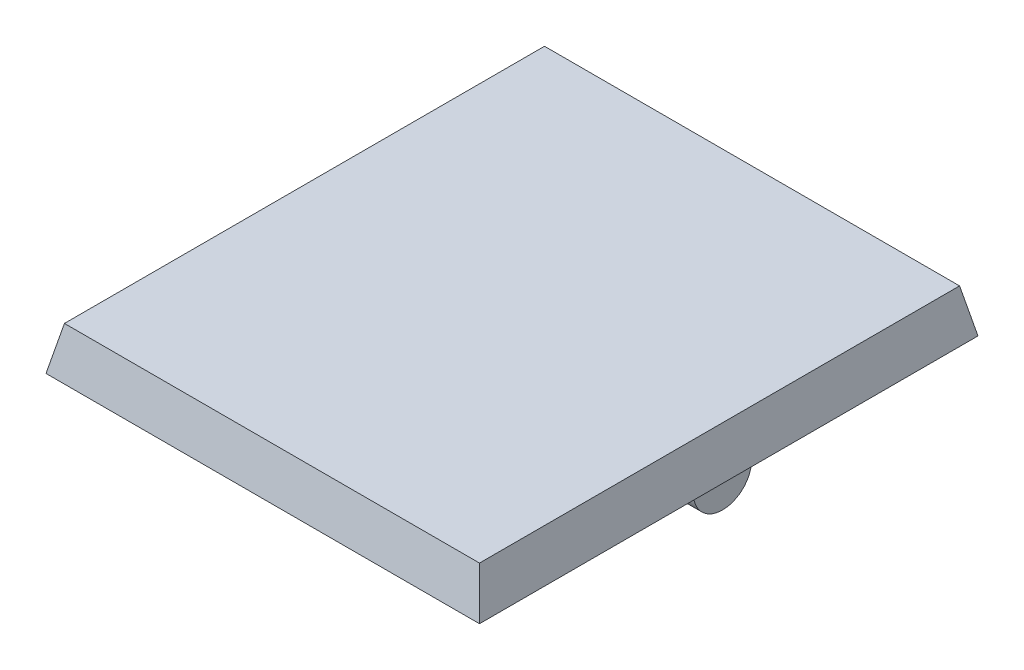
ISO-10303-21;
HEADER;
FILE_DESCRIPTION(('STEP AP214'),'2;1');
FILE_NAME('part.step','',(''),(''),'','','');
FILE_SCHEMA(('AUTOMOTIVE_DESIGN { 1 0 10303 214 1 1 1 1 }'));
ENDSEC;
DATA;
#1=APPLICATION_CONTEXT('core data for automotive mechanical design processes');
#2=APPLICATION_PROTOCOL_DEFINITION('international standard','automotive_design',2000,#1);
#3=PRODUCT_CONTEXT('',#1,'mechanical');
#4=PRODUCT('Part','Part','',(#3));
#5=PRODUCT_RELATED_PRODUCT_CATEGORY('part','',(#4));
#6=PRODUCT_DEFINITION_FORMATION('','',#4);
#7=PRODUCT_DEFINITION_CONTEXT('part definition',#1,'design');
#8=PRODUCT_DEFINITION('design','',#6,#7);
#9=PRODUCT_DEFINITION_SHAPE('','',#8);
#10=(LENGTH_UNIT() NAMED_UNIT(*) SI_UNIT(.MILLI.,.METRE.));
#11=(NAMED_UNIT(*) PLANE_ANGLE_UNIT() SI_UNIT($,.RADIAN.));
#12=(NAMED_UNIT(*) SI_UNIT($,.STERADIAN.) SOLID_ANGLE_UNIT());
#13=UNCERTAINTY_MEASURE_WITH_UNIT(LENGTH_MEASURE(1.E-05),#10,'distance_accuracy_value','');
#14=(GEOMETRIC_REPRESENTATION_CONTEXT(3) GLOBAL_UNCERTAINTY_ASSIGNED_CONTEXT((#13)) GLOBAL_UNIT_ASSIGNED_CONTEXT((#10,
#11,#12)) REPRESENTATION_CONTEXT('',''));
#15=CARTESIAN_POINT('',(0.,0.,0.));
#16=DIRECTION('',(0.,0.,1.));
#17=DIRECTION('',(1.,0.,0.));
#18=AXIS2_PLACEMENT_3D('',#15,#16,#17);
#19=CARTESIAN_POINT('',(0.143929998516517,-3.16012077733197,0.0591410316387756));
#20=DIRECTION('',(-1.,0.,0.));
#21=DIRECTION('',(0.,0.,-1.));
#22=AXIS2_PLACEMENT_3D('',#19,#20,#21);
#23=SPHERICAL_SURFACE('',#22,27.3992637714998);
#24=CARTESIAN_POINT('',(23.635525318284,-3.16012077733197,0.059141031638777));
#25=DIRECTION('',(-1.,0.,0.));
#26=DIRECTION('',(0.,0.,1.));
#27=AXIS2_PLACEMENT_3D('',#24,#25,#26);
#28=CIRCLE('',#27,14.1019361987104);
#29=CARTESIAN_POINT('',(23.635525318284,-3.16012077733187,-14.0427951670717));
#30=VERTEX_POINT('',#29);
#31=CARTESIAN_POINT('',(23.635525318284,-3.16012077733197,14.1610772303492));
#32=VERTEX_POINT('',#31);
#33=EDGE_CURVE('E12',#30,#32,#28,.T.);
#34=ORIENTED_EDGE('',*,*,#33,.T.);
#35=CARTESIAN_POINT('',(0.143929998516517,-3.16012077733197,0.0591410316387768));
#36=DIRECTION('',(0.,1.,0.));
#37=DIRECTION('',(0.,0.,1.));
#38=AXIS2_PLACEMENT_3D('',#35,#36,#37);
#39=CIRCLE('',#38,27.3992637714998);
#40=CARTESIAN_POINT('',(-23.707474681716,-3.16012077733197,13.5435820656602));
#41=VERTEX_POINT('',#40);
#42=EDGE_CURVE('E104',#41,#32,#39,.T.);
#43=ORIENTED_EDGE('',*,*,#42,.F.);
#44=CARTESIAN_POINT('',(-23.707474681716,-3.16012077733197,0.0591410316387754));
#45=DIRECTION('',(-1.,0.,0.));
#46=DIRECTION('',(0.,0.,1.));
#47=AXIS2_PLACEMENT_3D('',#44,#45,#46);
#48=CIRCLE('',#47,13.4844410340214);
#49=CARTESIAN_POINT('',(-23.707474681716,-3.16012077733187,-13.4253000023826));
#50=VERTEX_POINT('',#49);
#51=EDGE_CURVE('E60',#50,#41,#48,.T.);
#52=ORIENTED_EDGE('',*,*,#51,.F.);
#53=CARTESIAN_POINT('',(0.143929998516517,-3.16012077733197,0.0591410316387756));
#54=DIRECTION('',(0.,-1.,0.));
#55=DIRECTION('',(0.,0.,-1.));
#56=AXIS2_PLACEMENT_3D('',#53,#54,#55);
#57=CIRCLE('',#56,27.3992637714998);
#58=EDGE_CURVE('E111',#50,#30,#57,.T.);
#59=ORIENTED_EDGE('',*,*,#58,.T.);
#60=EDGE_LOOP('',(#34,#43,#52,#59));
#61=FACE_BOUND('',#60,.T.);
#62=ADVANCED_FACE('F50',(#61),#23,.T.);
#63=CARTESIAN_POINT('',(24.9164299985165,-3.16012077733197,0.0591410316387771));
#64=DIRECTION('',(-1.,0.,0.));
#65=DIRECTION('',(0.,0.,1.));
#66=AXIS2_PLACEMENT_3D('',#63,#64,#65);
#67=CYLINDRICAL_SURFACE('',#66,14.1019361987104);
#68=DIRECTION('',(1.,0.,0.));
#69=VECTOR('',#68,1.);
#70=CARTESIAN_POINT('',(23.635525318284,-3.16012077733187,-14.0427951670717));
#71=LINE('',#70,#69);
#72=CARTESIAN_POINT('',(81.364474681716,-3.16012077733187,-14.0427951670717));
#73=VERTEX_POINT('',#72);
#74=EDGE_CURVE('E113',#30,#73,#71,.T.);
#75=ORIENTED_EDGE('',*,*,#74,.T.);
#76=CARTESIAN_POINT('',(81.364474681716,-3.16012077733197,0.059141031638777));
#77=DIRECTION('',(-1.,0.,0.));
#78=DIRECTION('',(0.,0.,1.));
#79=AXIS2_PLACEMENT_3D('',#76,#77,#78);
#80=CIRCLE('',#79,14.1019361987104);
#81=CARTESIAN_POINT('',(81.364474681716,-3.16012077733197,14.1610772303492));
#82=VERTEX_POINT('',#81);
#83=EDGE_CURVE('E119',#73,#82,#80,.T.);
#84=ORIENTED_EDGE('',*,*,#83,.T.);
#85=DIRECTION('',(1.,0.,0.));
#86=VECTOR('',#85,1.);
#87=CARTESIAN_POINT('',(23.635525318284,-3.16012077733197,14.1610772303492));
#88=LINE('',#87,#86);
#89=EDGE_CURVE('E107',#32,#82,#88,.T.);
#90=ORIENTED_EDGE('',*,*,#89,.F.);
#91=ORIENTED_EDGE('',*,*,#33,.F.);
#92=EDGE_LOOP('',(#75,#84,#90,#91));
#93=FACE_BOUND('',#92,.T.);
#94=ADVANCED_FACE('F160',(#93),#67,.T.);
#95=CARTESIAN_POINT('',(24.9164299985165,-3.16012077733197,0.0591410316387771));
#96=DIRECTION('',(-1.,0.,0.));
#97=DIRECTION('',(0.,0.,1.));
#98=AXIS2_PLACEMENT_3D('',#95,#96,#97);
#99=CYLINDRICAL_SURFACE('',#98,13.4844410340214);
#100=DIRECTION('',(1.,0.,0.));
#101=VECTOR('',#100,1.);
#102=CARTESIAN_POINT('',(-24.6285700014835,-3.16012077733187,-13.4253000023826));
#103=LINE('',#102,#101);
#104=CARTESIAN_POINT('',(-44.6285700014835,-3.16012077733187,-13.4253000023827));
#105=VERTEX_POINT('',#104);
#106=EDGE_CURVE('E80',#105,#50,#103,.T.);
#107=ORIENTED_EDGE('',*,*,#106,.T.);
#108=ORIENTED_EDGE('',*,*,#51,.T.);
#109=DIRECTION('',(1.,0.,0.));
#110=VECTOR('',#109,1.);
#111=CARTESIAN_POINT('',(-24.6285700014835,-3.16012077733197,13.5435820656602));
#112=LINE('',#111,#110);
#113=CARTESIAN_POINT('',(-44.6285700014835,-3.16012077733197,13.5435820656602));
#114=VERTEX_POINT('',#113);
#115=EDGE_CURVE('E88',#114,#41,#112,.T.);
#116=ORIENTED_EDGE('',*,*,#115,.F.);
#117=CARTESIAN_POINT('',(-44.6285700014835,-3.16012077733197,0.0591410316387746));
#118=DIRECTION('',(-0.994521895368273,-0.104528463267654,0.));
#119=DIRECTION('',(-0.104528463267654,0.994521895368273,0.));
#120=AXIS2_PLACEMENT_3D('',#117,#118,#119);
#121=ELLIPSE('',#120,13.5587171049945,13.4844410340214);
#122=EDGE_CURVE('E118',#105,#114,#121,.T.);
#123=ORIENTED_EDGE('',*,*,#122,.F.);
#124=EDGE_LOOP('',(#107,#108,#116,#123));
#125=FACE_BOUND('',#124,.T.);
#126=ADVANCED_FACE('F101',(#125),#99,.T.);
#127=CARTESIAN_POINT('',(0.143929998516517,-3.16012077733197,0.0591410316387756));
#128=DIRECTION('',(0.,-1.,0.));
#129=DIRECTION('',(0.,0.,-1.));
#130=AXIS2_PLACEMENT_3D('',#127,#128,#129);
#131=PLANE('',#130);
#132=ORIENTED_EDGE('',*,*,#58,.F.);
#133=ORIENTED_EDGE('',*,*,#106,.F.);
#134=DIRECTION('',(0.,0.,-1.));
#135=VECTOR('',#134,1.);
#136=CARTESIAN_POINT('',(-44.6285700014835,-3.16012077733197,0.059141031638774));
#137=LINE('',#136,#135);
#138=EDGE_CURVE('E54',#114,#105,#137,.T.);
#139=ORIENTED_EDGE('',*,*,#138,.F.);
#140=ORIENTED_EDGE('',*,*,#115,.T.);
#141=ORIENTED_EDGE('',*,*,#42,.T.);
#142=ORIENTED_EDGE('',*,*,#89,.T.);
#143=CARTESIAN_POINT('',(104.856070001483,-3.16012077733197,0.0591410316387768));
#144=DIRECTION('',(0.,-1.,0.));
#145=DIRECTION('',(0.,0.,1.));
#146=AXIS2_PLACEMENT_3D('',#143,#144,#145);
#147=CIRCLE('',#146,27.3992637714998);
#148=CARTESIAN_POINT('',(128.707474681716,-3.16012077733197,13.5435820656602));
#149=VERTEX_POINT('',#148);
#150=EDGE_CURVE('E136',#149,#82,#147,.T.);
#151=ORIENTED_EDGE('',*,*,#150,.F.);
#152=DIRECTION('',(-1.,0.,0.));
#153=VECTOR('',#152,1.);
#154=CARTESIAN_POINT('',(129.628570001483,-3.16012077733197,13.5435820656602));
#155=LINE('',#154,#153);
#156=CARTESIAN_POINT('',(149.628570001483,-3.16012077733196,13.5435820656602));
#157=VERTEX_POINT('',#156);
#158=EDGE_CURVE('E133',#157,#149,#155,.T.);
#159=ORIENTED_EDGE('',*,*,#158,.F.);
#160=DIRECTION('',(0.,0.,1.));
#161=VECTOR('',#160,1.);
#162=CARTESIAN_POINT('',(149.628570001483,-3.16012077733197,-13.4253000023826));
#163=LINE('',#162,#161);
#164=CARTESIAN_POINT('',(149.628570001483,-3.16012077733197,-13.4253000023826));
#165=VERTEX_POINT('',#164);
#166=EDGE_CURVE('E139',#165,#157,#163,.T.);
#167=ORIENTED_EDGE('',*,*,#166,.F.);
#168=DIRECTION('',(-1.,0.,0.));
#169=VECTOR('',#168,1.);
#170=CARTESIAN_POINT('',(129.628570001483,-3.16012077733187,-13.4253000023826));
#171=LINE('',#170,#169);
#172=CARTESIAN_POINT('',(128.707474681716,-3.16012077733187,-13.4253000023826));
#173=VERTEX_POINT('',#172);
#174=EDGE_CURVE('E95',#165,#173,#171,.T.);
#175=ORIENTED_EDGE('',*,*,#174,.T.);
#176=CARTESIAN_POINT('',(104.856070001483,-3.16012077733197,0.0591410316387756));
#177=DIRECTION('',(0.,1.,0.));
#178=DIRECTION('',(0.,0.,-1.));
#179=AXIS2_PLACEMENT_3D('',#176,#177,#178);
#180=CIRCLE('',#179,27.3992637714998);
#181=EDGE_CURVE('E131',#173,#73,#180,.T.);
#182=ORIENTED_EDGE('',*,*,#181,.T.);
#183=ORIENTED_EDGE('',*,*,#74,.F.);
#184=EDGE_LOOP('',(#132,#133,#139,#140,#141,#142,#151,#159,#167,#175,#182,#183));
#185=FACE_BOUND('',#184,.T.);
#186=ADVANCED_FACE('F109',(#185),#131,.F.);
#187=CARTESIAN_POINT('',(-44.6285700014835,-3.16012077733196,0.));
#188=DIRECTION('',(-0.994521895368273,-0.104528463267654,0.));
#189=DIRECTION('',(0.104528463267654,-0.994521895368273,0.));
#190=AXIS2_PLACEMENT_3D('',#187,#188,#189);
#191=PLANE('',#190);
#192=ORIENTED_EDGE('',*,*,#122,.T.);
#193=ORIENTED_EDGE('',*,*,#138,.T.);
#194=EDGE_LOOP('',(#192,#193));
#195=FACE_BOUND('',#194,.T.);
#196=ADVANCED_FACE('F52',(#195),#191,.T.);
#197=CARTESIAN_POINT('',(104.856070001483,-3.16012077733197,0.0591410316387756));
#198=DIRECTION('',(1.,0.,0.));
#199=DIRECTION('',(0.,0.,-1.));
#200=AXIS2_PLACEMENT_3D('',#197,#198,#199);
#201=SPHERICAL_SURFACE('',#200,27.3992637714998);
#202=ORIENTED_EDGE('',*,*,#83,.F.);
#203=ORIENTED_EDGE('',*,*,#181,.F.);
#204=CARTESIAN_POINT('',(128.707474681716,-3.16012077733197,0.0591410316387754));
#205=DIRECTION('',(-1.,0.,0.));
#206=DIRECTION('',(0.,0.,1.));
#207=AXIS2_PLACEMENT_3D('',#204,#205,#206);
#208=CIRCLE('',#207,13.4844410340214);
#209=EDGE_CURVE('E122',#173,#149,#208,.T.);
#210=ORIENTED_EDGE('',*,*,#209,.T.);
#211=ORIENTED_EDGE('',*,*,#150,.T.);
#212=EDGE_LOOP('',(#202,#203,#210,#211));
#213=FACE_BOUND('',#212,.T.);
#214=ADVANCED_FACE('F157',(#213),#201,.T.);
#215=CARTESIAN_POINT('',(80.0835700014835,-3.16012077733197,0.0591410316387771));
#216=DIRECTION('',(1.,0.,0.));
#217=DIRECTION('',(0.,0.,1.));
#218=AXIS2_PLACEMENT_3D('',#215,#216,#217);
#219=CYLINDRICAL_SURFACE('',#218,13.4844410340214);
#220=ORIENTED_EDGE('',*,*,#174,.F.);
#221=CARTESIAN_POINT('',(149.628570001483,-3.16012077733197,0.0591410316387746));
#222=DIRECTION('',(1.,0.,0.));
#223=DIRECTION('',(0.,0.,-1.));
#224=AXIS2_PLACEMENT_3D('',#221,#222,#223);
#225=CIRCLE('',#224,13.4844410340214);
#226=EDGE_CURVE('E142',#157,#165,#225,.T.);
#227=ORIENTED_EDGE('',*,*,#226,.F.);
#228=ORIENTED_EDGE('',*,*,#158,.T.);
#229=ORIENTED_EDGE('',*,*,#209,.F.);
#230=EDGE_LOOP('',(#220,#227,#228,#229));
#231=FACE_BOUND('',#230,.T.);
#232=ADVANCED_FACE('F151',(#231),#219,.T.);
#233=CARTESIAN_POINT('',(149.628570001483,-3.16012077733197,0.0591410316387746));
#234=DIRECTION('',(1.,0.,0.));
#235=DIRECTION('',(0.,0.,-1.));
#236=AXIS2_PLACEMENT_3D('',#233,#234,#235);
#237=PLANE('',#236);
#238=ORIENTED_EDGE('',*,*,#226,.T.);
#239=ORIENTED_EDGE('',*,*,#166,.T.);
#240=EDGE_LOOP('',(#238,#239));
#241=FACE_BOUND('',#240,.T.);
#242=ADVANCED_FACE('F147',(#241),#237,.T.);
#243=CLOSED_SHELL('',(#62,#94,#126,#186,#196,#214,#232,#242));
#244=MANIFOLD_SOLID_BREP('B2',#243);
#245=CARTESIAN_POINT('',(-47.5,-3.16012077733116,-114.940858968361));
#246=DIRECTION('',(0.,0.207911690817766,-0.978147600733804));
#247=DIRECTION('',(0.,0.978147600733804,0.207911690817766));
#248=AXIS2_PLACEMENT_3D('',#245,#246,#247);
#249=PLANE('',#248);
#250=DIRECTION('',(1.,0.,0.));
#251=VECTOR('',#250,1.);
#252=CARTESIAN_POINT('',(-47.5,-3.16012077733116,-114.940858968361));
#253=LINE('',#252,#251);
#254=CARTESIAN_POINT('',(-47.5,-3.16012077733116,-114.940858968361));
#255=VERTEX_POINT('',#254);
#256=CARTESIAN_POINT('',(152.5,-3.16012077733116,-114.940858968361));
#257=VERTEX_POINT('',#256);
#258=EDGE_CURVE('E310',#255,#257,#253,.T.);
#259=ORIENTED_EDGE('',*,*,#258,.F.);
#260=DIRECTION('',(-0.203558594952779,-0.957667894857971,-0.203558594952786));
#261=VECTOR('',#260,1.);
#262=CARTESIAN_POINT('',(-37.9696966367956,41.6764313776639,-105.410555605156));
#263=LINE('',#262,#261);
#264=CARTESIAN_POINT('',(-43.2488687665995,16.8398792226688,-110.689727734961));
#265=VERTEX_POINT('',#264);
#266=EDGE_CURVE('E48',#265,#255,#263,.T.);
#267=ORIENTED_EDGE('',*,*,#266,.F.);
#268=DIRECTION('',(1.,0.,0.));
#269=VECTOR('',#268,1.);
#270=CARTESIAN_POINT('',(-47.5,16.8398792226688,-110.689727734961));
#271=LINE('',#270,#269);
#272=CARTESIAN_POINT('',(148.2488687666,16.8398792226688,-110.689727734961));
#273=VERTEX_POINT('',#272);
#274=EDGE_CURVE('E312',#265,#273,#271,.T.);
#275=ORIENTED_EDGE('',*,*,#274,.T.);
#276=DIRECTION('',(-0.203558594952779,0.957667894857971,0.203558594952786));
#277=VECTOR('',#276,1.);
#278=CARTESIAN_POINT('',(142.969696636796,41.6764313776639,-105.410555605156));
#279=LINE('',#278,#277);
#280=EDGE_CURVE('E307',#273,#257,#279,.F.);
#281=ORIENTED_EDGE('',*,*,#280,.T.);
#282=EDGE_LOOP('',(#259,#267,#275,#281));
#283=FACE_BOUND('',#282,.T.);
#284=ADVANCED_FACE('F260',(#283),#249,.T.);
#285=CARTESIAN_POINT('',(-47.5,-3.16012077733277,115.059141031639));
#286=DIRECTION('',(-0.978147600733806,0.207911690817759,0.));
#287=DIRECTION('',(-0.207911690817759,-0.978147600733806,0.));
#288=AXIS2_PLACEMENT_3D('',#285,#286,#287);
#289=PLANE('',#288);
#290=DIRECTION('',(0.,0.,-1.));
#291=VECTOR('',#290,1.);
#292=CARTESIAN_POINT('',(-47.5,-3.16012077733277,115.059141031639));
#293=LINE('',#292,#291);
#294=CARTESIAN_POINT('',(-47.5,-3.16012077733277,115.059141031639));
#295=VERTEX_POINT('',#294);
#296=EDGE_CURVE('E325',#295,#255,#293,.T.);
#297=ORIENTED_EDGE('',*,*,#296,.F.);
#298=DIRECTION('',(0.203558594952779,0.957667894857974,-0.203558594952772));
#299=VECTOR('',#298,1.);
#300=CARTESIAN_POINT('',(-47.5,-3.16012077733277,115.059141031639));
#301=LINE('',#300,#299);
#302=CARTESIAN_POINT('',(-43.2488687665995,16.8398792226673,110.808009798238));
#303=VERTEX_POINT('',#302);
#304=EDGE_CURVE('E270',#303,#295,#301,.F.);
#305=ORIENTED_EDGE('',*,*,#304,.F.);
#306=DIRECTION('',(0.,0.,-1.));
#307=VECTOR('',#306,1.);
#308=CARTESIAN_POINT('',(-43.2488687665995,16.8398792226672,115.059141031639));
#309=LINE('',#308,#307);
#310=EDGE_CURVE('E315',#303,#265,#309,.T.);
#311=ORIENTED_EDGE('',*,*,#310,.T.);
#312=ORIENTED_EDGE('',*,*,#266,.T.);
#313=EDGE_LOOP('',(#297,#305,#311,#312));
#314=FACE_BOUND('',#313,.T.);
#315=ADVANCED_FACE('F262',(#314),#289,.T.);
#316=CARTESIAN_POINT('',(-47.5,-3.16012077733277,115.059141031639));
#317=DIRECTION('',(0.,0.207911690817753,0.978147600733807));
#318=DIRECTION('',(0.,-0.978147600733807,0.207911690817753));
#319=AXIS2_PLACEMENT_3D('',#316,#317,#318);
#320=PLANE('',#319);
#321=DIRECTION('',(1.,0.,0.));
#322=VECTOR('',#321,1.);
#323=CARTESIAN_POINT('',(-47.5,-3.16012077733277,115.059141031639));
#324=LINE('',#323,#322);
#325=CARTESIAN_POINT('',(152.5,-3.16012077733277,115.059141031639));
#326=VERTEX_POINT('',#325);
#327=EDGE_CURVE('E322',#295,#326,#324,.T.);
#328=ORIENTED_EDGE('',*,*,#327,.T.);
#329=DIRECTION('',(0.203558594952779,-0.957667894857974,0.203558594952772));
#330=VECTOR('',#329,1.);
#331=CARTESIAN_POINT('',(152.5,-3.16012077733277,115.059141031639));
#332=LINE('',#331,#330);
#333=CARTESIAN_POINT('',(148.2488687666,16.8398792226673,110.808009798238));
#334=VERTEX_POINT('',#333);
#335=EDGE_CURVE('E314',#334,#326,#332,.T.);
#336=ORIENTED_EDGE('',*,*,#335,.F.);
#337=DIRECTION('',(-1.,0.,0.));
#338=VECTOR('',#337,1.);
#339=CARTESIAN_POINT('',(-47.5,16.8398792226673,110.808009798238));
#340=LINE('',#339,#338);
#341=EDGE_CURVE('E290',#303,#334,#340,.F.);
#342=ORIENTED_EDGE('',*,*,#341,.F.);
#343=ORIENTED_EDGE('',*,*,#304,.T.);
#344=EDGE_LOOP('',(#328,#336,#342,#343));
#345=FACE_BOUND('',#344,.T.);
#346=ADVANCED_FACE('F341',(#345),#320,.T.);
#347=CARTESIAN_POINT('',(152.5,-3.16012077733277,115.059141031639));
#348=DIRECTION('',(0.978147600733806,0.207911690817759,0.));
#349=DIRECTION('',(-0.207911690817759,0.978147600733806,0.));
#350=AXIS2_PLACEMENT_3D('',#347,#348,#349);
#351=PLANE('',#350);
#352=DIRECTION('',(0.,0.,-1.));
#353=VECTOR('',#352,1.);
#354=CARTESIAN_POINT('',(152.5,-3.16012077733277,115.059141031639));
#355=LINE('',#354,#353);
#356=EDGE_CURVE('E319',#326,#257,#355,.T.);
#357=ORIENTED_EDGE('',*,*,#356,.T.);
#358=ORIENTED_EDGE('',*,*,#280,.F.);
#359=DIRECTION('',(0.,0.,1.));
#360=VECTOR('',#359,1.);
#361=CARTESIAN_POINT('',(148.2488687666,16.8398792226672,115.059141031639));
#362=LINE('',#361,#360);
#363=EDGE_CURVE('E264',#334,#273,#362,.F.);
#364=ORIENTED_EDGE('',*,*,#363,.F.);
#365=ORIENTED_EDGE('',*,*,#335,.T.);
#366=EDGE_LOOP('',(#357,#358,#364,#365));
#367=FACE_BOUND('',#366,.T.);
#368=ADVANCED_FACE('F320',(#367),#351,.T.);
#369=CARTESIAN_POINT('',(0.,16.839879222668,1.17588503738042E-13));
#370=DIRECTION('',(0.,1.,0.));
#371=DIRECTION('',(0.,0.,1.));
#372=AXIS2_PLACEMENT_3D('',#369,#370,#371);
#373=PLANE('',#372);
#374=ORIENTED_EDGE('',*,*,#274,.F.);
#375=ORIENTED_EDGE('',*,*,#310,.F.);
#376=ORIENTED_EDGE('',*,*,#341,.T.);
#377=ORIENTED_EDGE('',*,*,#363,.T.);
#378=EDGE_LOOP('',(#374,#375,#376,#377));
#379=FACE_BOUND('',#378,.T.);
#380=ADVANCED_FACE('F333',(#379),#373,.T.);
#381=CARTESIAN_POINT('',(0.,-3.16012077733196,0.));
#382=DIRECTION('',(0.,1.,0.));
#383=DIRECTION('',(0.,0.,1.));
#384=AXIS2_PLACEMENT_3D('',#381,#382,#383);
#385=PLANE('',#384);
#386=ORIENTED_EDGE('',*,*,#258,.T.);
#387=ORIENTED_EDGE('',*,*,#356,.F.);
#388=ORIENTED_EDGE('',*,*,#327,.F.);
#389=ORIENTED_EDGE('',*,*,#296,.T.);
#390=EDGE_LOOP('',(#386,#387,#388,#389));
#391=FACE_BOUND('',#390,.T.);
#392=ADVANCED_FACE('F324',(#391),#385,.F.);
#393=CLOSED_SHELL('',(#284,#315,#346,#368,#380,#392));
#394=MANIFOLD_SOLID_BREP('B6',#393);
#395=ADVANCED_BREP_SHAPE_REPRESENTATION('',(#18,#244,#394),#14);
#396=SHAPE_DEFINITION_REPRESENTATION(#9,#395);
ENDSEC;
END-ISO-10303-21;
